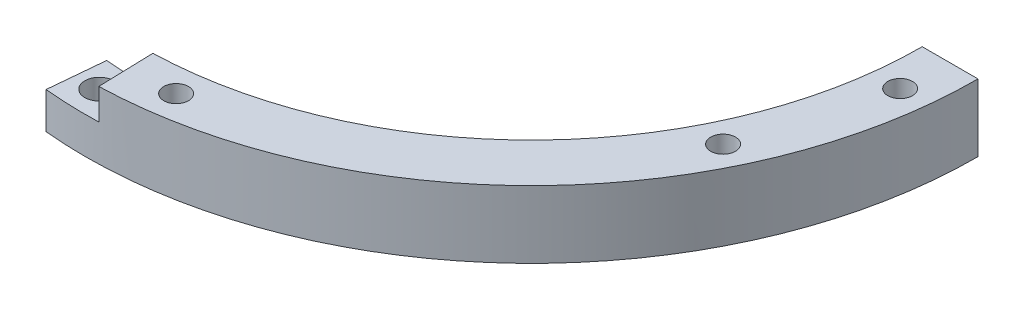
from build123d import *

# Parameters (mm, degrees)
SKETCH1_W                                     = 7.366
SKETCH1_H                                     = 8.89
REVOLVE1_ANGLE                                = 290
CUT_EXTRUDE1_DEPTH                            = 84.809608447
CBORE_FOR_4_SOCKET_HEAD_CAP_SCREW1_AT_2_COUNT = 2
CBORE_FOR_4_SOCKET_HEAD_CAP_SCREW1_AT_2_PITCH = 68.588890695
CBORE_FOR_4_SOCKET_HEAD_CAP_SCREW1_AT_3_COUNT = 2
CBORE_FOR_4_SOCKET_HEAD_CAP_SCREW1_AT_3_PITCH = 110.355775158
CBORE_FOR_4_SOCKET_HEAD_CAP_SCREW1_AT_4_COUNT = 2
CBORE_FOR_4_SOCKET_HEAD_CAP_SCREW1_AT_4_PITCH = 108.779272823
CBORE_FOR_4_SOCKET_HEAD_CAP_SCREW1_AT_5_COUNT = 2
CBORE_FOR_4_SOCKET_HEAD_CAP_SCREW1_AT_5_PITCH = 87.480024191
CBORE_FOR_4_SOCKET_HEAD_CAP_SCREW1_AT_6_COUNT = 2
CBORE_FOR_4_SOCKET_HEAD_CAP_SCREW1_AT_6_PITCH = 82.341214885
CUT_EXTRUDE2_DEPTH                            = 4.064
SKETCH7_W                                     = 1.9304
SKETCH7_H                                     = 4.826
SKETCH9_W                                     = 1.9304
SKETCH9_H                                     = 4.826


with BuildPart() as part:
    # Sketch1 → Revolve1 (revolve)
    with BuildSketch(Plane.XY):
        with Locations((55.245, -40.2082)):
            Rectangle(SKETCH1_W, SKETCH1_H)
    revolve(axis=Axis((0, 0, 0), (0, -1, 0)), revolution_arc=REVOLVE1_ANGLE)

    # Sketch2 → Cut-Extrude1 (cut, through all)
    with BuildSketch(Plane(origin=(0, -35.7632, 0), x_dir=(-1, 0, 0), z_dir=(0, 1, 0))):
        with BuildLine():
            Line((0, 0), (58.396657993, 7.895537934))
            ThreePointArc((58.396657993, 7.895537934), (40.78661295, 42.531886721), (5.443213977, 58.676065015))
            Line((5.443213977, 58.676065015), (0, 0))
        make_face()
    extrude(amount=-CUT_EXTRUDE1_DEPTH, mode=Mode.SUBTRACT)


with BuildPart() as cut_extrude1_piece_1:
    # of the separate pieces the step leaves, piece 1, a body of its own (cut_extrude1_pieces)
    add(part.part.solids().sort_by_distance((-51.097075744, -35.7632, 6.908595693))[0])

    # Sketch3 → CBORE for _4 Socket Head Cap Screw1 (revolve, cut)
    with BuildSketch(Plane(origin=(-54.702070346, -44.6532, -6.716569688), x_dir=(0, 0, -1), z_dir=(1, 0, 0))):
        Polygon((0, 0), (0, 15.24), (1.63195, 15.24), (1.63195, 4.445), (2.77876, 4.445), (2.77876, 0), align=None)
    cbore_for_4_socket_head_cap_screw1 = revolve(axis=Axis((-54.702070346, -51.0032, -6.716569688), (0, 1, 0)), mode=Mode.SUBTRACT)

    # CBORE for _4 Socket Head Cap Screw1 at 2: CBORE for _4 Socket Head Cap Screw1 ×2
    with Locations(*[Vector(0.7119322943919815, 0, -0.7022481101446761) * (i * CBORE_FOR_4_SOCKET_HEAD_CAP_SCREW1_AT_2_PITCH) for i in range(1, CBORE_FOR_4_SOCKET_HEAD_CAP_SCREW1_AT_2_COUNT)]):
        add(cbore_for_4_socket_head_cap_screw1, mode=Mode.SUBTRACT)

    # CBORE for _4 Socket Head Cap Screw1 at 6: CBORE for _4 Socket Head Cap Screw1 ×2
    with Locations(*[Vector(0.8211089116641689, 0, -0.5707715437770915) * (i * CBORE_FOR_4_SOCKET_HEAD_CAP_SCREW1_AT_6_PITCH) for i in range(1, CBORE_FOR_4_SOCKET_HEAD_CAP_SCREW1_AT_6_COUNT)]):
        add(cbore_for_4_socket_head_cap_screw1, mode=Mode.SUBTRACT)


with BuildPart() as cut_extrude1_piece_2:
    # of the separate pieces the step leaves, piece 2, a body of its own (cut_extrude1_pieces)
    add(part.part.solids().sort_by_distance((58.928, -35.7632, 0))[0])

    # CBORE for _4 Socket Head Cap Screw1 at 3: CBORE for _4 Socket Head Cap Screw1 ×2
    with Locations(*[Vector(0.9930828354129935, 0, 0.11741585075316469) * (i * CBORE_FOR_4_SOCKET_HEAD_CAP_SCREW1_AT_3_PITCH) for i in range(1, CBORE_FOR_4_SOCKET_HEAD_CAP_SCREW1_AT_3_COUNT)]):
        add(cbore_for_4_socket_head_cap_screw1, mode=Mode.SUBTRACT)

    # CBORE for _4 Socket Head Cap Screw1 at 4: CBORE for _4 Socket Head Cap Screw1 ×2
    with Locations(*[Vector(0.9585195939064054, 0, 0.28502664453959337) * (i * CBORE_FOR_4_SOCKET_HEAD_CAP_SCREW1_AT_4_PITCH) for i in range(1, CBORE_FOR_4_SOCKET_HEAD_CAP_SCREW1_AT_4_COUNT)]):
        add(cbore_for_4_socket_head_cap_screw1, mode=Mode.SUBTRACT)

    # CBORE for _4 Socket Head Cap Screw1 at 5: CBORE for _4 Socket Head Cap Screw1 ×2
    with Locations(*[Vector(0.7130533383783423, 0, 0.7011097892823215) * (i * CBORE_FOR_4_SOCKET_HEAD_CAP_SCREW1_AT_5_PITCH) for i in range(1, CBORE_FOR_4_SOCKET_HEAD_CAP_SCREW1_AT_5_COUNT)]):
        add(cbore_for_4_socket_head_cap_screw1, mode=Mode.SUBTRACT)


with BuildPart() as cut_extrude2_tool:
    # Sketch6 → Cut-Extrude2 (new body)
    with BuildSketch(Plane(origin=(0, -35.7632, 0), x_dir=(-1, 0, 0), z_dir=(0, 1, 0))):
        with BuildLine():
            Line((0, 0), (-1.748172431, 58.902063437))
            ThreePointArc((-1.748172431, 58.902063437), (40.78661295, 42.531886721), (58.923602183, 0.719923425))
            Line((58.923602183, 0.719923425), (0, 0))
        make_face()
    extrude(amount=-CUT_EXTRUDE2_DEPTH)


with BuildPart() as cut_extrude1_piece_1_1:
    add(cut_extrude1_piece_1.part)

    # Cut-Extrude2: cut by cut_extrude2_tool
    add(cut_extrude2_tool.part, mode=Mode.SUBTRACT)

    # Sketch7 → 24 _0.152_ Diameter Hole1 (revolve, cut)
    with BuildSketch(Plane(origin=(-54.977404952, -39.8272, 4.262735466), x_dir=(0, 0, 1), z_dir=(1, 0, 0))):
        with Locations((0.9652, 2.413)):
            Rectangle(SKETCH7_W, SKETCH7_H)
    revolve(axis=Axis((-54.977404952, -33.4772, 4.262735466), (0, -1, 0)), mode=Mode.SUBTRACT)


with BuildPart() as cut_extrude1_piece_2_1:
    add(cut_extrude1_piece_2.part)

    # Cut-Extrude2: cut by cut_extrude2_tool
    add(cut_extrude2_tool.part, mode=Mode.SUBTRACT)

    # Sketch9 → 24 _0.152_ Diameter Hole2 (revolve, cut)
    with BuildSketch(Plane(origin=(-1.95678155, -39.8272, 55.107685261), x_dir=(0, 0, 1), z_dir=(1, 0, 0))):
        with Locations((0.9652, 2.413)):
            Rectangle(SKETCH9_W, SKETCH9_H)
    revolve(axis=Axis((-1.95678155, -33.4772, 55.107685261), (0, -1, 0)), mode=Mode.SUBTRACT)


solid = cut_extrude1_piece_2_1.part
